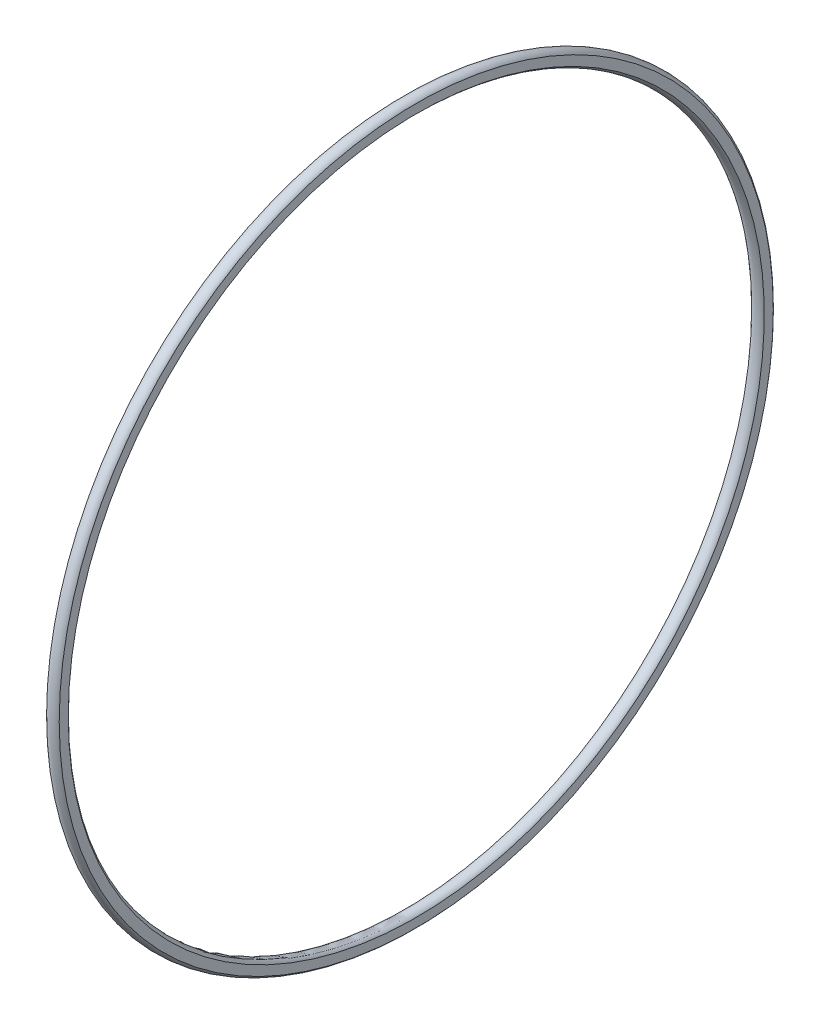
ISO-10303-21;
HEADER;
FILE_DESCRIPTION(('STEP AP214'),'2;1');
FILE_NAME('part.step','',(''),(''),'','','');
FILE_SCHEMA(('AUTOMOTIVE_DESIGN { 1 0 10303 214 1 1 1 1 }'));
ENDSEC;
DATA;
#1=APPLICATION_CONTEXT('core data for automotive mechanical design processes');
#2=APPLICATION_PROTOCOL_DEFINITION('international standard','automotive_design',2000,#1);
#3=PRODUCT_CONTEXT('',#1,'mechanical');
#4=PRODUCT('Part','Part','',(#3));
#5=PRODUCT_RELATED_PRODUCT_CATEGORY('part','',(#4));
#6=PRODUCT_DEFINITION_FORMATION('','',#4);
#7=PRODUCT_DEFINITION_CONTEXT('part definition',#1,'design');
#8=PRODUCT_DEFINITION('design','',#6,#7);
#9=PRODUCT_DEFINITION_SHAPE('','',#8);
#10=(LENGTH_UNIT() NAMED_UNIT(*) SI_UNIT(.MILLI.,.METRE.));
#11=(NAMED_UNIT(*) PLANE_ANGLE_UNIT() SI_UNIT($,.RADIAN.));
#12=(NAMED_UNIT(*) SI_UNIT($,.STERADIAN.) SOLID_ANGLE_UNIT());
#13=UNCERTAINTY_MEASURE_WITH_UNIT(LENGTH_MEASURE(1.E-05),#10,'distance_accuracy_value','');
#14=(GEOMETRIC_REPRESENTATION_CONTEXT(3) GLOBAL_UNCERTAINTY_ASSIGNED_CONTEXT((#13)) GLOBAL_UNIT_ASSIGNED_CONTEXT((#10,
#11,#12)) REPRESENTATION_CONTEXT('',''));
#15=CARTESIAN_POINT('',(0.,0.,0.));
#16=DIRECTION('',(0.,0.,1.));
#17=DIRECTION('',(1.,0.,0.));
#18=AXIS2_PLACEMENT_3D('',#15,#16,#17);
#19=CARTESIAN_POINT('',(11.5835164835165,0.,0.));
#20=DIRECTION('',(-1.,0.,0.));
#21=DIRECTION('',(0.,0.,1.));
#22=AXIS2_PLACEMENT_3D('',#19,#20,#21);
#23=TOROIDAL_SURFACE('',#22,68.5,1.5);
#24=CARTESIAN_POINT('',(10.5,0.,0.));
#25=DIRECTION('',(-1.,0.,0.));
#26=DIRECTION('',(0.,0.,1.));
#27=AXIS2_PLACEMENT_3D('',#24,#25,#26);
#28=CIRCLE('',#27,69.5373003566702);
#29=CARTESIAN_POINT('',(10.5,0.,69.5373003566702));
#30=VERTEX_POINT('',#29);
#31=EDGE_CURVE('E10',#30,#30,#28,.T.);
#32=ORIENTED_EDGE('',*,*,#31,.F.);
#33=EDGE_LOOP('',(#32));
#34=FACE_BOUND('',#33,.T.);
#35=CARTESIAN_POINT('',(12.8,0.,0.));
#36=DIRECTION('',(1.,0.,0.));
#37=DIRECTION('',(0.,0.,-1.));
#38=AXIS2_PLACEMENT_3D('',#35,#36,#37);
#39=CIRCLE('',#38,69.377592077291);
#40=CARTESIAN_POINT('',(12.8,0.,-69.377592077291));
#41=VERTEX_POINT('',#40);
#42=EDGE_CURVE('E30',#41,#41,#39,.T.);
#43=ORIENTED_EDGE('',*,*,#42,.F.);
#44=EDGE_LOOP('',(#43));
#45=FACE_BOUND('',#44,.T.);
#46=ADVANCED_FACE('F27',(#34,#45),#23,.T.);
#47=CARTESIAN_POINT('',(10.5,0.,0.));
#48=DIRECTION('',(1.,0.,0.));
#49=DIRECTION('',(0.,0.,-1.));
#50=AXIS2_PLACEMENT_3D('',#47,#48,#49);
#51=CIRCLE('',#50,67.4626996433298);
#52=CARTESIAN_POINT('',(10.5,0.,-67.4626996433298));
#53=VERTEX_POINT('',#52);
#54=EDGE_CURVE('E34',#53,#53,#51,.T.);
#55=ORIENTED_EDGE('',*,*,#54,.F.);
#56=EDGE_LOOP('',(#55));
#57=FACE_BOUND('',#56,.T.);
#58=CARTESIAN_POINT('',(12.8,0.,0.));
#59=DIRECTION('',(-1.,0.,0.));
#60=DIRECTION('',(0.,0.,1.));
#61=AXIS2_PLACEMENT_3D('',#58,#59,#60);
#62=CIRCLE('',#61,67.622407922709);
#63=CARTESIAN_POINT('',(12.8,0.,67.622407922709));
#64=VERTEX_POINT('',#63);
#65=EDGE_CURVE('E40',#64,#64,#62,.T.);
#66=ORIENTED_EDGE('',*,*,#65,.F.);
#67=EDGE_LOOP('',(#66));
#68=FACE_BOUND('',#67,.T.);
#69=ADVANCED_FACE('F50',(#57,#68),#23,.T.);
#70=CARTESIAN_POINT('',(10.5,-122.138401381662,-85.6128865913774));
#71=DIRECTION('',(-1.,0.,0.));
#72=DIRECTION('',(0.,0.,1.));
#73=AXIS2_PLACEMENT_3D('',#70,#71,#72);
#74=PLANE('',#73);
#75=ORIENTED_EDGE('',*,*,#54,.T.);
#76=EDGE_LOOP('',(#75));
#77=FACE_BOUND('',#76,.T.);
#78=ORIENTED_EDGE('',*,*,#31,.T.);
#79=EDGE_LOOP('',(#78));
#80=FACE_BOUND('',#79,.T.);
#81=ADVANCED_FACE('F55',(#77,#80),#74,.T.);
#82=CARTESIAN_POINT('',(12.8,-86.8411946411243,101.737167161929));
#83=DIRECTION('',(1.,0.,0.));
#84=DIRECTION('',(0.,0.,-1.));
#85=AXIS2_PLACEMENT_3D('',#82,#83,#84);
#86=PLANE('',#85);
#87=ORIENTED_EDGE('',*,*,#65,.T.);
#88=EDGE_LOOP('',(#87));
#89=FACE_BOUND('',#88,.T.);
#90=ORIENTED_EDGE('',*,*,#42,.T.);
#91=EDGE_LOOP('',(#90));
#92=FACE_BOUND('',#91,.T.);
#93=ADVANCED_FACE('F47',(#89,#92),#86,.T.);
#94=CLOSED_SHELL('',(#46,#69,#81,#93));
#95=MANIFOLD_SOLID_BREP('B2',#94);
#96=ADVANCED_BREP_SHAPE_REPRESENTATION('',(#18,#95),#14);
#97=SHAPE_DEFINITION_REPRESENTATION(#9,#96);
ENDSEC;
END-ISO-10303-21;
